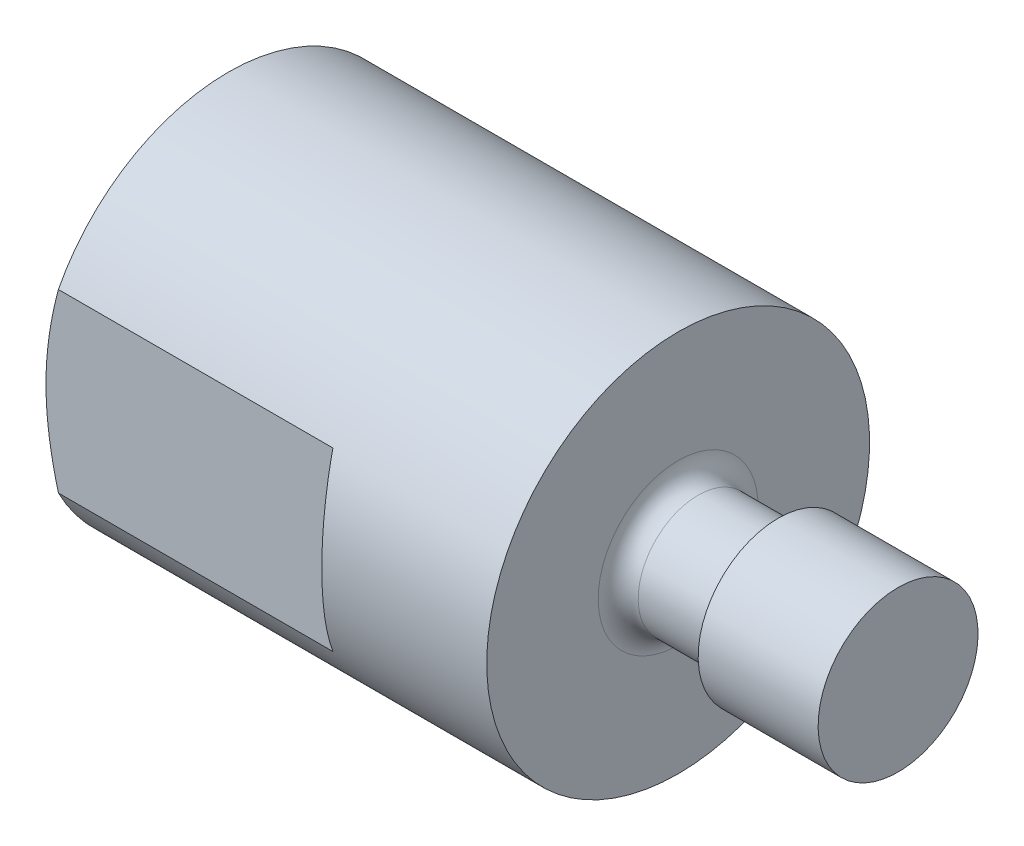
from build123d import *

# Parameters (mm, degrees)
CONG_1_R                   = 1
TROU_TARAUD_M10X1_02_D     = 9
TROU_TARAUD_M10X1_02_DEPTH = 17
TROU_TARAUD_M10X1_02_TIP   = 2.703872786
ESQUISSE4_R                = 19
EXTRUSION1_DEPTH           = 1.075
CHANFREIN1_SIZE            = 1


with BuildPart() as part:
    # Esquisse1 → R_volution1 (revolve)
    with BuildSketch(Plane.XY):
        Polygon((0, 0), (0, 7.842949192), (1, 9.575), (23.5, 9.575), (23.5, 3), (28.5, 3), (28.5, 4), (34.5, 4), (34.5, 0), align=None)
    revolve(axis=Axis((34.5, 0, 0), (-1, 0, 0)))

    # Cong_1
    cong_1_edges = [part.edges().sort_by_distance(p)[0] for p in [
        (23.5, -3, 0),
    ]]
    fillet(cong_1_edges, radius=CONG_1_R)

    # Trou taraud_ M10x1.02
    with Locations(Plane(origin=(0, 0, 0), x_dir=(0, -1, 0), z_dir=(-1, 0, 0))):
        with Locations((0, 0)):
            Hole(TROU_TARAUD_M10X1_02_D / 2, depth=TROU_TARAUD_M10X1_02_DEPTH)
            with Locations((0, 0, -(TROU_TARAUD_M10X1_02_DEPTH + TROU_TARAUD_M10X1_02_TIP / 2))):  # 118° drill point
                Cone(0, TROU_TARAUD_M10X1_02_D / 2, TROU_TARAUD_M10X1_02_TIP, mode=Mode.SUBTRACT)

    # Esquisse4 → Extrusion1 (cut)
    with BuildSketch(Plane.XY.offset(9.575)):
        with Locations((-3.75, 0)):
            Circle(ESQUISSE4_R)
    extrusion1 = extrude(amount=-EXTRUSION1_DEPTH, mode=Mode.SUBTRACT)

    # Sym_trie1: Extrusion1 across plane
    add(extrusion1.mirror(Plane.XY), mode=Mode.SUBTRACT)

    # Chanfrein1
    chanfrein1_edges = [part.edges().sort_by_distance(p)[0] for p in [
        (0, -4.5, 0),
    ]]
    chamfer(chanfrein1_edges, length=CHANFREIN1_SIZE)


solid = part.part
